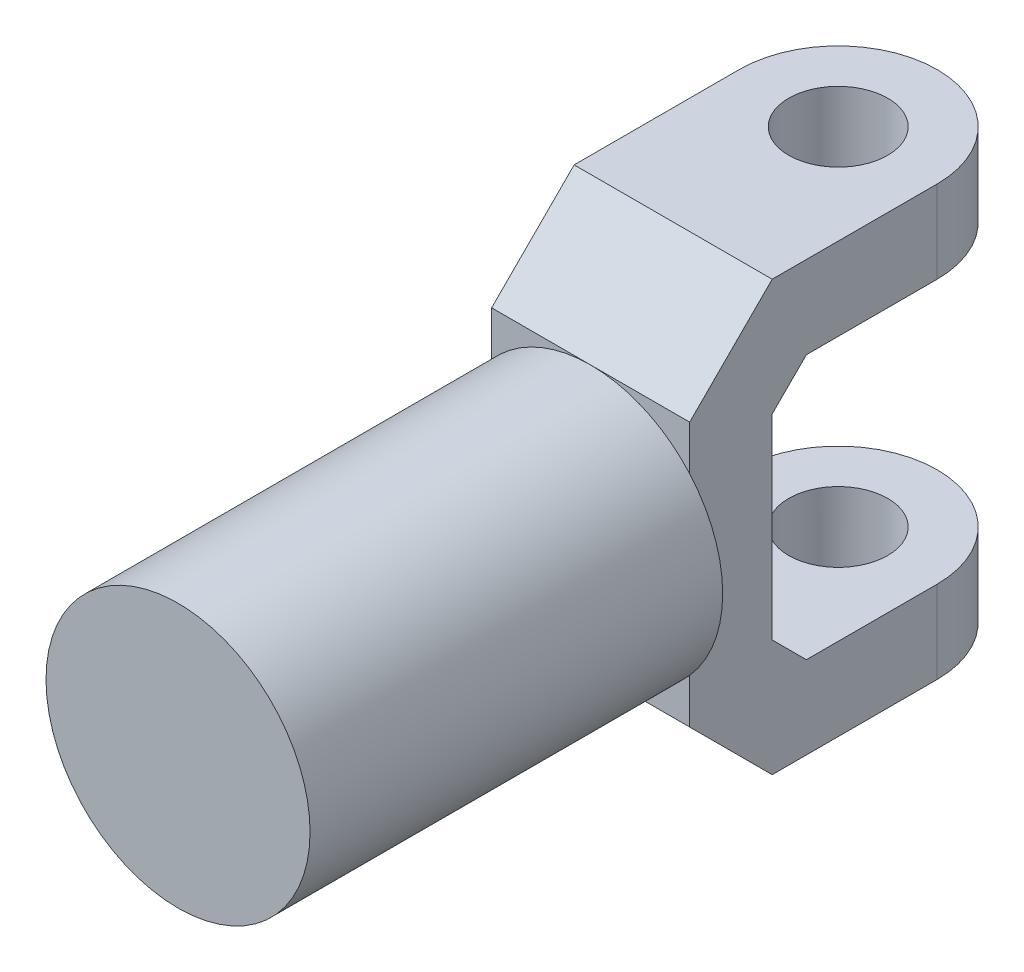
ISO-10303-21;
HEADER;
FILE_DESCRIPTION(('STEP AP214'),'2;1');
FILE_NAME('part.step','',(''),(''),'','','');
FILE_SCHEMA(('AUTOMOTIVE_DESIGN { 1 0 10303 214 1 1 1 1 }'));
ENDSEC;
DATA;
#1=APPLICATION_CONTEXT('core data for automotive mechanical design processes');
#2=APPLICATION_PROTOCOL_DEFINITION('international standard','automotive_design',2000,#1);
#3=PRODUCT_CONTEXT('',#1,'mechanical');
#4=PRODUCT('Part','Part','',(#3));
#5=PRODUCT_RELATED_PRODUCT_CATEGORY('part','',(#4));
#6=PRODUCT_DEFINITION_FORMATION('','',#4);
#7=PRODUCT_DEFINITION_CONTEXT('part definition',#1,'design');
#8=PRODUCT_DEFINITION('design','',#6,#7);
#9=PRODUCT_DEFINITION_SHAPE('','',#8);
#10=(LENGTH_UNIT() NAMED_UNIT(*) SI_UNIT(.MILLI.,.METRE.));
#11=(NAMED_UNIT(*) PLANE_ANGLE_UNIT() SI_UNIT($,.RADIAN.));
#12=(NAMED_UNIT(*) SI_UNIT($,.STERADIAN.) SOLID_ANGLE_UNIT());
#13=UNCERTAINTY_MEASURE_WITH_UNIT(LENGTH_MEASURE(1.E-05),#10,'distance_accuracy_value','');
#14=(GEOMETRIC_REPRESENTATION_CONTEXT(3) GLOBAL_UNCERTAINTY_ASSIGNED_CONTEXT((#13)) GLOBAL_UNIT_ASSIGNED_CONTEXT((#10,
#11,#12)) REPRESENTATION_CONTEXT('',''));
#15=CARTESIAN_POINT('',(0.,0.,0.));
#16=DIRECTION('',(0.,0.,1.));
#17=DIRECTION('',(1.,0.,0.));
#18=AXIS2_PLACEMENT_3D('',#15,#16,#17);
#19=CARTESIAN_POINT('',(0.,0.,0.));
#20=DIRECTION('',(0.,0.,1.));
#21=DIRECTION('',(1.,0.,0.));
#22=AXIS2_PLACEMENT_3D('',#19,#20,#21);
#23=PLANE('',#22);
#24=DIRECTION('',(0.,-1.,0.));
#25=VECTOR('',#24,1.);
#26=CARTESIAN_POINT('',(30.,-40.,0.));
#27=LINE('',#26,#25);
#28=CARTESIAN_POINT('',(30.,26.4575131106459,0.));
#29=VERTEX_POINT('',#28);
#30=CARTESIAN_POINT('',(30.,-26.4575131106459,0.));
#31=VERTEX_POINT('',#30);
#32=EDGE_CURVE('E168',#29,#31,#27,.T.);
#33=ORIENTED_EDGE('',*,*,#32,.F.);
#34=CARTESIAN_POINT('',(0.,0.,0.));
#35=DIRECTION('',(0.,0.,1.));
#36=DIRECTION('',(1.,0.,0.));
#37=AXIS2_PLACEMENT_3D('',#34,#35,#36);
#38=CIRCLE('',#37,40.);
#39=EDGE_CURVE('E183',#31,#29,#38,.T.);
#40=ORIENTED_EDGE('',*,*,#39,.F.);
#41=EDGE_LOOP('',(#33,#40));
#42=FACE_BOUND('',#41,.T.);
#43=ADVANCED_FACE('F36',(#42),#23,.F.);
#44=CARTESIAN_POINT('',(0.,0.,125.));
#45=DIRECTION('',(0.,0.,-1.));
#46=DIRECTION('',(-1.,0.,0.));
#47=AXIS2_PLACEMENT_3D('',#44,#45,#46);
#48=CYLINDRICAL_SURFACE('',#47,40.);
#49=CARTESIAN_POINT('',(0.,0.,125.));
#50=DIRECTION('',(0.,0.,1.));
#51=DIRECTION('',(1.,0.,0.));
#52=AXIS2_PLACEMENT_3D('',#49,#50,#51);
#53=CIRCLE('',#52,40.);
#54=CARTESIAN_POINT('',(40.,0.,125.));
#55=VERTEX_POINT('',#54);
#56=EDGE_CURVE('E192',#55,#55,#53,.T.);
#57=ORIENTED_EDGE('',*,*,#56,.F.);
#58=EDGE_LOOP('',(#57));
#59=FACE_BOUND('',#58,.T.);
#60=CARTESIAN_POINT('',(0.,40.,0.));
#61=VERTEX_POINT('',#60);
#62=EDGE_CURVE('E162',#29,#61,#38,.T.);
#63=ORIENTED_EDGE('',*,*,#62,.T.);
#64=CARTESIAN_POINT('',(-30.,26.4575131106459,0.));
#65=VERTEX_POINT('',#64);
#66=EDGE_CURVE('E195',#61,#65,#38,.T.);
#67=ORIENTED_EDGE('',*,*,#66,.T.);
#68=CARTESIAN_POINT('',(-30.,-26.4575131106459,0.));
#69=VERTEX_POINT('',#68);
#70=EDGE_CURVE('E372',#65,#69,#38,.T.);
#71=ORIENTED_EDGE('',*,*,#70,.T.);
#72=CARTESIAN_POINT('',(0.,-40.,0.));
#73=VERTEX_POINT('',#72);
#74=EDGE_CURVE('E303',#69,#73,#38,.T.);
#75=ORIENTED_EDGE('',*,*,#74,.T.);
#76=EDGE_CURVE('E186',#73,#31,#38,.T.);
#77=ORIENTED_EDGE('',*,*,#76,.T.);
#78=ORIENTED_EDGE('',*,*,#39,.T.);
#79=EDGE_LOOP('',(#63,#67,#71,#75,#77,#78));
#80=FACE_BOUND('',#79,.T.);
#81=ADVANCED_FACE('F351',(#59,#80),#48,.T.);
#82=CARTESIAN_POINT('',(0.,0.,125.));
#83=DIRECTION('',(0.,0.,1.));
#84=DIRECTION('',(1.,0.,0.));
#85=AXIS2_PLACEMENT_3D('',#82,#83,#84);
#86=PLANE('',#85);
#87=ORIENTED_EDGE('',*,*,#56,.T.);
#88=EDGE_LOOP('',(#87));
#89=FACE_BOUND('',#88,.T.);
#90=ADVANCED_FACE('F358',(#89),#86,.T.);
#91=ORIENTED_EDGE('',*,*,#70,.F.);
#92=DIRECTION('',(0.,-1.,0.));
#93=VECTOR('',#92,1.);
#94=CARTESIAN_POINT('',(-30.,-40.,0.));
#95=LINE('',#94,#93);
#96=EDGE_CURVE('E199',#65,#69,#95,.T.);
#97=ORIENTED_EDGE('',*,*,#96,.T.);
#98=EDGE_LOOP('',(#91,#97));
#99=FACE_BOUND('',#98,.T.);
#100=ADVANCED_FACE('F354',(#99),#23,.F.);
#101=CARTESIAN_POINT('',(30.,-40.,0.));
#102=DIRECTION('',(0.,0.,-1.));
#103=DIRECTION('',(-1.,0.,0.));
#104=AXIS2_PLACEMENT_3D('',#101,#102,#103);
#105=PLANE('',#104);
#106=ORIENTED_EDGE('',*,*,#62,.F.);
#107=CARTESIAN_POINT('',(30.,40.,0.));
#108=VERTEX_POINT('',#107);
#109=EDGE_CURVE('E157',#108,#29,#27,.T.);
#110=ORIENTED_EDGE('',*,*,#109,.F.);
#111=DIRECTION('',(-1.,0.,0.));
#112=VECTOR('',#111,1.);
#113=CARTESIAN_POINT('',(30.,40.,0.));
#114=LINE('',#113,#112);
#115=EDGE_CURVE('E161',#108,#61,#114,.T.);
#116=ORIENTED_EDGE('',*,*,#115,.T.);
#117=EDGE_LOOP('',(#106,#110,#116));
#118=FACE_BOUND('',#117,.T.);
#119=ADVANCED_FACE('F159',(#118),#105,.F.);
#120=ORIENTED_EDGE('',*,*,#66,.F.);
#121=CARTESIAN_POINT('',(-30.,40.,0.));
#122=VERTEX_POINT('',#121);
#123=EDGE_CURVE('E182',#61,#122,#114,.T.);
#124=ORIENTED_EDGE('',*,*,#123,.T.);
#125=EDGE_CURVE('E253',#122,#65,#95,.T.);
#126=ORIENTED_EDGE('',*,*,#125,.T.);
#127=EDGE_LOOP('',(#120,#124,#126));
#128=FACE_BOUND('',#127,.T.);
#129=ADVANCED_FACE('F368',(#128),#105,.F.);
#130=ORIENTED_EDGE('',*,*,#74,.F.);
#131=CARTESIAN_POINT('',(-30.,-40.,0.));
#132=VERTEX_POINT('',#131);
#133=EDGE_CURVE('E251',#69,#132,#95,.T.);
#134=ORIENTED_EDGE('',*,*,#133,.T.);
#135=DIRECTION('',(-1.,0.,0.));
#136=VECTOR('',#135,1.);
#137=CARTESIAN_POINT('',(30.,-40.,0.));
#138=LINE('',#137,#136);
#139=EDGE_CURVE('E285',#73,#132,#138,.T.);
#140=ORIENTED_EDGE('',*,*,#139,.F.);
#141=EDGE_LOOP('',(#130,#134,#140));
#142=FACE_BOUND('',#141,.T.);
#143=ADVANCED_FACE('F306',(#142),#105,.F.);
#144=CARTESIAN_POINT('',(30.,40.,0.));
#145=DIRECTION('',(0.,-0.707106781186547,-0.707106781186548));
#146=DIRECTION('',(0.,0.707106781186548,-0.707106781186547));
#147=AXIS2_PLACEMENT_3D('',#144,#145,#146);
#148=PLANE('',#147);
#149=DIRECTION('',(0.,-0.707106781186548,0.707106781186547));
#150=VECTOR('',#149,1.);
#151=CARTESIAN_POINT('',(-30.,40.,0.));
#152=LINE('',#151,#150);
#153=CARTESIAN_POINT('',(-30.,65.,-25.));
#154=VERTEX_POINT('',#153);
#155=EDGE_CURVE('E249',#154,#122,#152,.T.);
#156=ORIENTED_EDGE('',*,*,#155,.T.);
#157=ORIENTED_EDGE('',*,*,#123,.F.);
#158=ORIENTED_EDGE('',*,*,#115,.F.);
#159=DIRECTION('',(0.,-0.707106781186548,0.707106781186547));
#160=VECTOR('',#159,1.);
#161=CARTESIAN_POINT('',(30.,40.,0.));
#162=LINE('',#161,#160);
#163=CARTESIAN_POINT('',(30.,65.,-25.));
#164=VERTEX_POINT('',#163);
#165=EDGE_CURVE('E170',#164,#108,#162,.T.);
#166=ORIENTED_EDGE('',*,*,#165,.F.);
#167=DIRECTION('',(-1.,0.,0.));
#168=VECTOR('',#167,1.);
#169=CARTESIAN_POINT('',(30.,65.,-25.));
#170=LINE('',#169,#168);
#171=EDGE_CURVE('E243',#164,#154,#170,.T.);
#172=ORIENTED_EDGE('',*,*,#171,.T.);
#173=EDGE_LOOP('',(#156,#157,#158,#166,#172));
#174=FACE_BOUND('',#173,.T.);
#175=ADVANCED_FACE('F181',(#174),#148,.F.);
#176=ORIENTED_EDGE('',*,*,#76,.F.);
#177=CARTESIAN_POINT('',(30.,-40.,0.));
#178=VERTEX_POINT('',#177);
#179=EDGE_CURVE('E188',#178,#73,#138,.T.);
#180=ORIENTED_EDGE('',*,*,#179,.F.);
#181=EDGE_CURVE('E166',#31,#178,#27,.T.);
#182=ORIENTED_EDGE('',*,*,#181,.F.);
#183=EDGE_LOOP('',(#176,#180,#182));
#184=FACE_BOUND('',#183,.T.);
#185=ADVANCED_FACE('F300',(#184),#105,.F.);
#186=CARTESIAN_POINT('',(30.,-40.,0.));
#187=DIRECTION('',(0.,0.707106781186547,-0.707106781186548));
#188=DIRECTION('',(0.,0.707106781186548,0.707106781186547));
#189=AXIS2_PLACEMENT_3D('',#186,#187,#188);
#190=PLANE('',#189);
#191=DIRECTION('',(0.,-0.707106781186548,-0.707106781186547));
#192=VECTOR('',#191,1.);
#193=CARTESIAN_POINT('',(-30.,-40.,0.));
#194=LINE('',#193,#192);
#195=CARTESIAN_POINT('',(-30.,-65.,-25.));
#196=VERTEX_POINT('',#195);
#197=EDGE_CURVE('E256',#132,#196,#194,.T.);
#198=ORIENTED_EDGE('',*,*,#197,.T.);
#199=DIRECTION('',(-1.,0.,0.));
#200=VECTOR('',#199,1.);
#201=CARTESIAN_POINT('',(30.,-65.,-25.));
#202=LINE('',#201,#200);
#203=CARTESIAN_POINT('',(30.,-65.,-25.));
#204=VERTEX_POINT('',#203);
#205=EDGE_CURVE('E283',#204,#196,#202,.T.);
#206=ORIENTED_EDGE('',*,*,#205,.F.);
#207=DIRECTION('',(0.,-0.707106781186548,-0.707106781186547));
#208=VECTOR('',#207,1.);
#209=CARTESIAN_POINT('',(30.,-40.,0.));
#210=LINE('',#209,#208);
#211=EDGE_CURVE('E165',#178,#204,#210,.T.);
#212=ORIENTED_EDGE('',*,*,#211,.F.);
#213=ORIENTED_EDGE('',*,*,#179,.T.);
#214=ORIENTED_EDGE('',*,*,#139,.T.);
#215=EDGE_LOOP('',(#198,#206,#212,#213,#214));
#216=FACE_BOUND('',#215,.T.);
#217=ADVANCED_FACE('F296',(#216),#190,.F.);
#218=CARTESIAN_POINT('',(30.,-65.,-25.));
#219=DIRECTION('',(0.,1.,0.));
#220=DIRECTION('',(0.,0.,1.));
#221=AXIS2_PLACEMENT_3D('',#218,#219,#220);
#222=PLANE('',#221);
#223=CARTESIAN_POINT('',(0.,-65.,-75.));
#224=DIRECTION('',(0.,1.,0.));
#225=DIRECTION('',(0.,0.,1.));
#226=AXIS2_PLACEMENT_3D('',#223,#224,#225);
#227=CIRCLE('',#226,15.);
#228=CARTESIAN_POINT('',(0.,-65.,-60.));
#229=VERTEX_POINT('',#228);
#230=EDGE_CURVE('E225',#229,#229,#227,.T.);
#231=ORIENTED_EDGE('',*,*,#230,.T.);
#232=EDGE_LOOP('',(#231));
#233=FACE_BOUND('',#232,.T.);
#234=DIRECTION('',(0.,0.,-1.));
#235=VECTOR('',#234,1.);
#236=CARTESIAN_POINT('',(-30.,-65.,-25.));
#237=LINE('',#236,#235);
#238=CARTESIAN_POINT('',(-30.,-65.,-75.));
#239=VERTEX_POINT('',#238);
#240=EDGE_CURVE('E258',#196,#239,#237,.T.);
#241=ORIENTED_EDGE('',*,*,#240,.T.);
#242=CARTESIAN_POINT('',(0.,-65.,-75.));
#243=DIRECTION('',(0.,1.,0.));
#244=DIRECTION('',(0.,0.,1.));
#245=AXIS2_PLACEMENT_3D('',#242,#243,#244);
#246=CIRCLE('',#245,30.);
#247=CARTESIAN_POINT('',(0.,-65.,-105.));
#248=VERTEX_POINT('',#247);
#249=EDGE_CURVE('E209',#239,#248,#246,.F.);
#250=ORIENTED_EDGE('',*,*,#249,.T.);
#251=CARTESIAN_POINT('',(0.,-65.,-75.));
#252=DIRECTION('',(0.,1.,0.));
#253=DIRECTION('',(0.,0.,1.));
#254=AXIS2_PLACEMENT_3D('',#251,#252,#253);
#255=CIRCLE('',#254,30.);
#256=CARTESIAN_POINT('',(30.,-65.,-75.));
#257=VERTEX_POINT('',#256);
#258=EDGE_CURVE('E207',#248,#257,#255,.F.);
#259=ORIENTED_EDGE('',*,*,#258,.T.);
#260=DIRECTION('',(0.,0.,-1.));
#261=VECTOR('',#260,1.);
#262=CARTESIAN_POINT('',(30.,-65.,-25.));
#263=LINE('',#262,#261);
#264=EDGE_CURVE('E313',#204,#257,#263,.T.);
#265=ORIENTED_EDGE('',*,*,#264,.F.);
#266=ORIENTED_EDGE('',*,*,#205,.T.);
#267=EDGE_LOOP('',(#241,#250,#259,#265,#266));
#268=FACE_BOUND('',#267,.T.);
#269=ADVANCED_FACE('F314',(#233,#268),#222,.F.);
#270=CARTESIAN_POINT('',(30.,-40.,-105.));
#271=DIRECTION('',(0.,-1.,0.));
#272=DIRECTION('',(0.,0.,-1.));
#273=AXIS2_PLACEMENT_3D('',#270,#271,#272);
#274=PLANE('',#273);
#275=CARTESIAN_POINT('',(0.,-40.,-75.));
#276=DIRECTION('',(0.,-1.,0.));
#277=DIRECTION('',(0.,0.,-1.));
#278=AXIS2_PLACEMENT_3D('',#275,#276,#277);
#279=CIRCLE('',#278,15.);
#280=CARTESIAN_POINT('',(0.,-40.,-90.));
#281=VERTEX_POINT('',#280);
#282=EDGE_CURVE('E252',#281,#281,#279,.T.);
#283=ORIENTED_EDGE('',*,*,#282,.T.);
#284=EDGE_LOOP('',(#283));
#285=FACE_BOUND('',#284,.T.);
#286=CARTESIAN_POINT('',(0.,-40.,-75.));
#287=DIRECTION('',(0.,-1.,0.));
#288=DIRECTION('',(0.,0.,-1.));
#289=AXIS2_PLACEMENT_3D('',#286,#287,#288);
#290=CIRCLE('',#289,30.);
#291=CARTESIAN_POINT('',(30.,-40.,-75.));
#292=VERTEX_POINT('',#291);
#293=CARTESIAN_POINT('',(0.,-40.,-105.));
#294=VERTEX_POINT('',#293);
#295=EDGE_CURVE('E196',#292,#294,#290,.F.);
#296=ORIENTED_EDGE('',*,*,#295,.T.);
#297=CARTESIAN_POINT('',(0.,-40.,-75.));
#298=DIRECTION('',(0.,-1.,0.));
#299=DIRECTION('',(0.,0.,-1.));
#300=AXIS2_PLACEMENT_3D('',#297,#298,#299);
#301=CIRCLE('',#300,30.);
#302=CARTESIAN_POINT('',(-30.,-40.,-75.));
#303=VERTEX_POINT('',#302);
#304=EDGE_CURVE('E198',#294,#303,#301,.F.);
#305=ORIENTED_EDGE('',*,*,#304,.T.);
#306=DIRECTION('',(0.,0.,1.));
#307=VECTOR('',#306,1.);
#308=CARTESIAN_POINT('',(-30.,-40.,-105.));
#309=LINE('',#308,#307);
#310=CARTESIAN_POINT('',(-30.,-40.,-35.3553390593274));
#311=VERTEX_POINT('',#310);
#312=EDGE_CURVE('E261',#303,#311,#309,.T.);
#313=ORIENTED_EDGE('',*,*,#312,.T.);
#314=DIRECTION('',(-1.,0.,0.));
#315=VECTOR('',#314,1.);
#316=CARTESIAN_POINT('',(30.,-40.,-35.3553390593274));
#317=LINE('',#316,#315);
#318=CARTESIAN_POINT('',(30.,-40.,-35.3553390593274));
#319=VERTEX_POINT('',#318);
#320=EDGE_CURVE('E281',#319,#311,#317,.T.);
#321=ORIENTED_EDGE('',*,*,#320,.F.);
#322=DIRECTION('',(0.,0.,1.));
#323=VECTOR('',#322,1.);
#324=CARTESIAN_POINT('',(30.,-40.,-105.));
#325=LINE('',#324,#323);
#326=EDGE_CURVE('E317',#292,#319,#325,.T.);
#327=ORIENTED_EDGE('',*,*,#326,.F.);
#328=EDGE_LOOP('',(#296,#305,#313,#321,#327));
#329=FACE_BOUND('',#328,.T.);
#330=ADVANCED_FACE('F405',(#285,#329),#274,.F.);
#331=CARTESIAN_POINT('',(30.,-40.,-35.3553390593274));
#332=DIRECTION('',(0.,-0.707106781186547,0.707106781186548));
#333=DIRECTION('',(0.,-0.707106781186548,-0.707106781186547));
#334=AXIS2_PLACEMENT_3D('',#331,#332,#333);
#335=PLANE('',#334);
#336=DIRECTION('',(0.,0.707106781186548,0.707106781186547));
#337=VECTOR('',#336,1.);
#338=CARTESIAN_POINT('',(-30.,-40.,-35.3553390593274));
#339=LINE('',#338,#337);
#340=CARTESIAN_POINT('',(-30.,-29.6446609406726,-25.));
#341=VERTEX_POINT('',#340);
#342=EDGE_CURVE('E263',#311,#341,#339,.T.);
#343=ORIENTED_EDGE('',*,*,#342,.T.);
#344=DIRECTION('',(-1.,0.,0.));
#345=VECTOR('',#344,1.);
#346=CARTESIAN_POINT('',(30.,-29.6446609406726,-25.));
#347=LINE('',#346,#345);
#348=CARTESIAN_POINT('',(30.,-29.6446609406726,-25.));
#349=VERTEX_POINT('',#348);
#350=EDGE_CURVE('E278',#349,#341,#347,.T.);
#351=ORIENTED_EDGE('',*,*,#350,.F.);
#352=DIRECTION('',(0.,0.707106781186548,0.707106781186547));
#353=VECTOR('',#352,1.);
#354=CARTESIAN_POINT('',(30.,-40.,-35.3553390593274));
#355=LINE('',#354,#353);
#356=EDGE_CURVE('E319',#319,#349,#355,.T.);
#357=ORIENTED_EDGE('',*,*,#356,.F.);
#358=ORIENTED_EDGE('',*,*,#320,.T.);
#359=EDGE_LOOP('',(#343,#351,#357,#358));
#360=FACE_BOUND('',#359,.T.);
#361=ADVANCED_FACE('F413',(#360),#335,.F.);
#362=CARTESIAN_POINT('',(30.,29.6446609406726,-25.));
#363=DIRECTION('',(0.,0.,1.));
#364=DIRECTION('',(1.,0.,0.));
#365=AXIS2_PLACEMENT_3D('',#362,#363,#364);
#366=PLANE('',#365);
#367=DIRECTION('',(0.,1.,0.));
#368=VECTOR('',#367,1.);
#369=CARTESIAN_POINT('',(-30.,29.6446609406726,-25.));
#370=LINE('',#369,#368);
#371=CARTESIAN_POINT('',(-30.,29.6446609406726,-25.));
#372=VERTEX_POINT('',#371);
#373=EDGE_CURVE('E265',#341,#372,#370,.T.);
#374=ORIENTED_EDGE('',*,*,#373,.T.);
#375=DIRECTION('',(-1.,0.,0.));
#376=VECTOR('',#375,1.);
#377=CARTESIAN_POINT('',(30.,29.6446609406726,-25.));
#378=LINE('',#377,#376);
#379=CARTESIAN_POINT('',(30.,29.6446609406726,-25.));
#380=VERTEX_POINT('',#379);
#381=EDGE_CURVE('E275',#380,#372,#378,.T.);
#382=ORIENTED_EDGE('',*,*,#381,.F.);
#383=DIRECTION('',(0.,1.,0.));
#384=VECTOR('',#383,1.);
#385=CARTESIAN_POINT('',(30.,29.6446609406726,-25.));
#386=LINE('',#385,#384);
#387=EDGE_CURVE('E245',#349,#380,#386,.T.);
#388=ORIENTED_EDGE('',*,*,#387,.F.);
#389=ORIENTED_EDGE('',*,*,#350,.T.);
#390=EDGE_LOOP('',(#374,#382,#388,#389));
#391=FACE_BOUND('',#390,.T.);
#392=ADVANCED_FACE('F328',(#391),#366,.F.);
#393=CARTESIAN_POINT('',(30.,40.,-35.3553390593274));
#394=DIRECTION('',(0.,0.707106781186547,0.707106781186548));
#395=DIRECTION('',(0.,-0.707106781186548,0.707106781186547));
#396=AXIS2_PLACEMENT_3D('',#393,#394,#395);
#397=PLANE('',#396);
#398=DIRECTION('',(0.,0.707106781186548,-0.707106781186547));
#399=VECTOR('',#398,1.);
#400=CARTESIAN_POINT('',(-30.,40.,-35.3553390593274));
#401=LINE('',#400,#399);
#402=CARTESIAN_POINT('',(-30.,40.,-35.3553390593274));
#403=VERTEX_POINT('',#402);
#404=EDGE_CURVE('E267',#372,#403,#401,.T.);
#405=ORIENTED_EDGE('',*,*,#404,.T.);
#406=DIRECTION('',(-1.,0.,0.));
#407=VECTOR('',#406,1.);
#408=CARTESIAN_POINT('',(30.,40.,-35.3553390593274));
#409=LINE('',#408,#407);
#410=CARTESIAN_POINT('',(30.,40.,-35.3553390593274));
#411=VERTEX_POINT('',#410);
#412=EDGE_CURVE('E273',#411,#403,#409,.T.);
#413=ORIENTED_EDGE('',*,*,#412,.F.);
#414=DIRECTION('',(0.,0.707106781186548,-0.707106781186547));
#415=VECTOR('',#414,1.);
#416=CARTESIAN_POINT('',(30.,40.,-35.3553390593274));
#417=LINE('',#416,#415);
#418=EDGE_CURVE('E240',#380,#411,#417,.T.);
#419=ORIENTED_EDGE('',*,*,#418,.F.);
#420=ORIENTED_EDGE('',*,*,#381,.T.);
#421=EDGE_LOOP('',(#405,#413,#419,#420));
#422=FACE_BOUND('',#421,.T.);
#423=ADVANCED_FACE('F332',(#422),#397,.F.);
#424=CARTESIAN_POINT('',(30.,40.,-105.));
#425=DIRECTION('',(0.,1.,0.));
#426=DIRECTION('',(0.,0.,1.));
#427=AXIS2_PLACEMENT_3D('',#424,#425,#426);
#428=PLANE('',#427);
#429=CARTESIAN_POINT('',(0.,40.,-75.));
#430=DIRECTION('',(0.,1.,0.));
#431=DIRECTION('',(0.,0.,1.));
#432=AXIS2_PLACEMENT_3D('',#429,#430,#431);
#433=CIRCLE('',#432,15.);
#434=CARTESIAN_POINT('',(0.,40.,-60.));
#435=VERTEX_POINT('',#434);
#436=EDGE_CURVE('E612',#435,#435,#433,.T.);
#437=ORIENTED_EDGE('',*,*,#436,.T.);
#438=EDGE_LOOP('',(#437));
#439=FACE_BOUND('',#438,.T.);
#440=DIRECTION('',(0.,0.,-1.));
#441=VECTOR('',#440,1.);
#442=CARTESIAN_POINT('',(-30.,40.,-105.));
#443=LINE('',#442,#441);
#444=CARTESIAN_POINT('',(-30.,40.,-75.));
#445=VERTEX_POINT('',#444);
#446=EDGE_CURVE('E269',#403,#445,#443,.T.);
#447=ORIENTED_EDGE('',*,*,#446,.T.);
#448=CARTESIAN_POINT('',(0.,40.,-75.));
#449=DIRECTION('',(0.,1.,0.));
#450=DIRECTION('',(0.,0.,1.));
#451=AXIS2_PLACEMENT_3D('',#448,#449,#450);
#452=CIRCLE('',#451,30.);
#453=CARTESIAN_POINT('',(0.,40.,-105.));
#454=VERTEX_POINT('',#453);
#455=EDGE_CURVE('E11',#445,#454,#452,.F.);
#456=ORIENTED_EDGE('',*,*,#455,.T.);
#457=CARTESIAN_POINT('',(0.,40.,-75.));
#458=DIRECTION('',(0.,1.,0.));
#459=DIRECTION('',(0.,0.,1.));
#460=AXIS2_PLACEMENT_3D('',#457,#458,#459);
#461=CIRCLE('',#460,30.);
#462=CARTESIAN_POINT('',(30.,40.,-75.));
#463=VERTEX_POINT('',#462);
#464=EDGE_CURVE('E45',#454,#463,#461,.F.);
#465=ORIENTED_EDGE('',*,*,#464,.T.);
#466=DIRECTION('',(0.,0.,-1.));
#467=VECTOR('',#466,1.);
#468=CARTESIAN_POINT('',(30.,40.,-105.));
#469=LINE('',#468,#467);
#470=EDGE_CURVE('E238',#411,#463,#469,.T.);
#471=ORIENTED_EDGE('',*,*,#470,.F.);
#472=ORIENTED_EDGE('',*,*,#412,.T.);
#473=EDGE_LOOP('',(#447,#456,#465,#471,#472));
#474=FACE_BOUND('',#473,.T.);
#475=ADVANCED_FACE('F236',(#439,#474),#428,.F.);
#476=CARTESIAN_POINT('',(30.,65.,-25.));
#477=DIRECTION('',(0.,-1.,0.));
#478=DIRECTION('',(0.,0.,-1.));
#479=AXIS2_PLACEMENT_3D('',#476,#477,#478);
#480=PLANE('',#479);
#481=CARTESIAN_POINT('',(0.,65.,-75.));
#482=DIRECTION('',(0.,1.,0.));
#483=DIRECTION('',(0.,0.,1.));
#484=AXIS2_PLACEMENT_3D('',#481,#482,#483);
#485=CIRCLE('',#484,15.);
#486=CARTESIAN_POINT('',(0.,65.,-60.));
#487=VERTEX_POINT('',#486);
#488=EDGE_CURVE('E220',#487,#487,#485,.T.);
#489=ORIENTED_EDGE('',*,*,#488,.F.);
#490=EDGE_LOOP('',(#489));
#491=FACE_BOUND('',#490,.T.);
#492=CARTESIAN_POINT('',(0.,65.,-75.));
#493=DIRECTION('',(0.,-1.,0.));
#494=DIRECTION('',(0.,0.,-1.));
#495=AXIS2_PLACEMENT_3D('',#492,#493,#494);
#496=CIRCLE('',#495,30.);
#497=CARTESIAN_POINT('',(30.,65.,-75.));
#498=VERTEX_POINT('',#497);
#499=CARTESIAN_POINT('',(0.,65.,-105.));
#500=VERTEX_POINT('',#499);
#501=EDGE_CURVE('E59',#498,#500,#496,.F.);
#502=ORIENTED_EDGE('',*,*,#501,.T.);
#503=CARTESIAN_POINT('',(0.,65.,-75.));
#504=DIRECTION('',(0.,-1.,0.));
#505=DIRECTION('',(0.,0.,-1.));
#506=AXIS2_PLACEMENT_3D('',#503,#504,#505);
#507=CIRCLE('',#506,30.);
#508=CARTESIAN_POINT('',(-30.,65.,-75.));
#509=VERTEX_POINT('',#508);
#510=EDGE_CURVE('E216',#500,#509,#507,.F.);
#511=ORIENTED_EDGE('',*,*,#510,.T.);
#512=DIRECTION('',(0.,0.,1.));
#513=VECTOR('',#512,1.);
#514=CARTESIAN_POINT('',(-30.,65.,-25.));
#515=LINE('',#514,#513);
#516=EDGE_CURVE('E177',#509,#154,#515,.T.);
#517=ORIENTED_EDGE('',*,*,#516,.T.);
#518=ORIENTED_EDGE('',*,*,#171,.F.);
#519=DIRECTION('',(0.,0.,1.));
#520=VECTOR('',#519,1.);
#521=CARTESIAN_POINT('',(30.,65.,-25.));
#522=LINE('',#521,#520);
#523=EDGE_CURVE('E173',#498,#164,#522,.T.);
#524=ORIENTED_EDGE('',*,*,#523,.F.);
#525=EDGE_LOOP('',(#502,#511,#517,#518,#524));
#526=FACE_BOUND('',#525,.T.);
#527=ADVANCED_FACE('F337',(#491,#526),#480,.F.);
#528=CARTESIAN_POINT('',(30.,0.,0.));
#529=DIRECTION('',(1.,0.,0.));
#530=DIRECTION('',(0.,0.,-1.));
#531=AXIS2_PLACEMENT_3D('',#528,#529,#530);
#532=PLANE('',#531);
#533=ORIENTED_EDGE('',*,*,#264,.T.);
#534=DIRECTION('',(0.,1.,0.));
#535=VECTOR('',#534,1.);
#536=CARTESIAN_POINT('',(30.,-40.,-75.));
#537=LINE('',#536,#535);
#538=EDGE_CURVE('E213',#257,#292,#537,.T.);
#539=ORIENTED_EDGE('',*,*,#538,.T.);
#540=ORIENTED_EDGE('',*,*,#326,.T.);
#541=ORIENTED_EDGE('',*,*,#356,.T.);
#542=ORIENTED_EDGE('',*,*,#387,.T.);
#543=ORIENTED_EDGE('',*,*,#418,.T.);
#544=ORIENTED_EDGE('',*,*,#470,.T.);
#545=DIRECTION('',(0.,1.,0.));
#546=VECTOR('',#545,1.);
#547=CARTESIAN_POINT('',(30.,65.,-75.));
#548=LINE('',#547,#546);
#549=EDGE_CURVE('E211',#463,#498,#548,.T.);
#550=ORIENTED_EDGE('',*,*,#549,.T.);
#551=ORIENTED_EDGE('',*,*,#523,.T.);
#552=ORIENTED_EDGE('',*,*,#165,.T.);
#553=ORIENTED_EDGE('',*,*,#109,.T.);
#554=ORIENTED_EDGE('',*,*,#32,.T.);
#555=ORIENTED_EDGE('',*,*,#181,.T.);
#556=ORIENTED_EDGE('',*,*,#211,.T.);
#557=EDGE_LOOP('',(#533,#539,#540,#541,#542,#543,#544,#550,#551,#552,#553,#554,#555,#556));
#558=FACE_BOUND('',#557,.T.);
#559=ADVANCED_FACE('F172',(#558),#532,.T.);
#560=CARTESIAN_POINT('',(-30.,0.,0.));
#561=DIRECTION('',(1.,0.,0.));
#562=DIRECTION('',(0.,0.,-1.));
#563=AXIS2_PLACEMENT_3D('',#560,#561,#562);
#564=PLANE('',#563);
#565=ORIENTED_EDGE('',*,*,#312,.F.);
#566=DIRECTION('',(0.,1.,0.));
#567=VECTOR('',#566,1.);
#568=CARTESIAN_POINT('',(-30.,0.,-75.));
#569=LINE('',#568,#567);
#570=EDGE_CURVE('E204',#303,#239,#569,.F.);
#571=ORIENTED_EDGE('',*,*,#570,.T.);
#572=ORIENTED_EDGE('',*,*,#240,.F.);
#573=ORIENTED_EDGE('',*,*,#197,.F.);
#574=ORIENTED_EDGE('',*,*,#133,.F.);
#575=ORIENTED_EDGE('',*,*,#96,.F.);
#576=ORIENTED_EDGE('',*,*,#125,.F.);
#577=ORIENTED_EDGE('',*,*,#155,.F.);
#578=ORIENTED_EDGE('',*,*,#516,.F.);
#579=DIRECTION('',(0.,1.,0.));
#580=VECTOR('',#579,1.);
#581=CARTESIAN_POINT('',(-30.,0.,-75.));
#582=LINE('',#581,#580);
#583=EDGE_CURVE('E201',#509,#445,#582,.F.);
#584=ORIENTED_EDGE('',*,*,#583,.T.);
#585=ORIENTED_EDGE('',*,*,#446,.F.);
#586=ORIENTED_EDGE('',*,*,#404,.F.);
#587=ORIENTED_EDGE('',*,*,#373,.F.);
#588=ORIENTED_EDGE('',*,*,#342,.F.);
#589=EDGE_LOOP('',(#565,#571,#572,#573,#574,#575,#576,#577,#578,#584,#585,#586,#587,#588));
#590=FACE_BOUND('',#589,.T.);
#591=ADVANCED_FACE('F312',(#590),#564,.F.);
#592=CARTESIAN_POINT('',(0.,-65.,-75.));
#593=DIRECTION('',(0.,1.,0.));
#594=DIRECTION('',(0.,0.,1.));
#595=AXIS2_PLACEMENT_3D('',#592,#593,#594);
#596=CYLINDRICAL_SURFACE('',#595,15.);
#597=ORIENTED_EDGE('',*,*,#488,.T.);
#598=EDGE_LOOP('',(#597));
#599=FACE_BOUND('',#598,.T.);
#600=ORIENTED_EDGE('',*,*,#436,.F.);
#601=EDGE_LOOP('',(#600));
#602=FACE_BOUND('',#601,.T.);
#603=ADVANCED_FACE('F460',(#599,#602),#596,.F.);
#604=ORIENTED_EDGE('',*,*,#230,.F.);
#605=EDGE_LOOP('',(#604));
#606=FACE_BOUND('',#605,.T.);
#607=ORIENTED_EDGE('',*,*,#282,.F.);
#608=EDGE_LOOP('',(#607));
#609=FACE_BOUND('',#608,.T.);
#610=ADVANCED_FACE('F473',(#606,#609),#596,.F.);
#611=CARTESIAN_POINT('',(0.,0.,-75.));
#612=DIRECTION('',(0.,-1.,0.));
#613=DIRECTION('',(0.,0.,-1.));
#614=AXIS2_PLACEMENT_3D('',#611,#612,#613);
#615=CYLINDRICAL_SURFACE('',#614,30.);
#616=ORIENTED_EDGE('',*,*,#538,.F.);
#617=ORIENTED_EDGE('',*,*,#258,.F.);
#618=DIRECTION('',(0.,1.,0.));
#619=VECTOR('',#618,1.);
#620=CARTESIAN_POINT('',(0.,-65.,-105.));
#621=LINE('',#620,#619);
#622=EDGE_CURVE('E218',#294,#248,#621,.F.);
#623=ORIENTED_EDGE('',*,*,#622,.F.);
#624=ORIENTED_EDGE('',*,*,#295,.F.);
#625=EDGE_LOOP('',(#616,#617,#623,#624));
#626=FACE_BOUND('',#625,.T.);
#627=ADVANCED_FACE('F467',(#626),#615,.T.);
#628=CARTESIAN_POINT('',(0.,-65.,-75.));
#629=DIRECTION('',(0.,1.,0.));
#630=DIRECTION('',(0.,0.,1.));
#631=AXIS2_PLACEMENT_3D('',#628,#629,#630);
#632=CYLINDRICAL_SURFACE('',#631,30.);
#633=ORIENTED_EDGE('',*,*,#249,.F.);
#634=ORIENTED_EDGE('',*,*,#570,.F.);
#635=ORIENTED_EDGE('',*,*,#304,.F.);
#636=ORIENTED_EDGE('',*,*,#622,.T.);
#637=EDGE_LOOP('',(#633,#634,#635,#636));
#638=FACE_BOUND('',#637,.T.);
#639=ADVANCED_FACE('F472',(#638),#632,.T.);
#640=CARTESIAN_POINT('',(0.,0.,-75.));
#641=DIRECTION('',(0.,-1.,0.));
#642=DIRECTION('',(0.,0.,-1.));
#643=AXIS2_PLACEMENT_3D('',#640,#641,#642);
#644=CYLINDRICAL_SURFACE('',#643,30.);
#645=ORIENTED_EDGE('',*,*,#549,.F.);
#646=ORIENTED_EDGE('',*,*,#464,.F.);
#647=DIRECTION('',(0.,1.,0.));
#648=VECTOR('',#647,1.);
#649=CARTESIAN_POINT('',(0.,40.,-105.));
#650=LINE('',#649,#648);
#651=EDGE_CURVE('E40',#500,#454,#650,.F.);
#652=ORIENTED_EDGE('',*,*,#651,.F.);
#653=ORIENTED_EDGE('',*,*,#501,.F.);
#654=EDGE_LOOP('',(#645,#646,#652,#653));
#655=FACE_BOUND('',#654,.T.);
#656=ADVANCED_FACE('F38',(#655),#644,.T.);
#657=CARTESIAN_POINT('',(0.,65.,-75.));
#658=DIRECTION('',(0.,1.,0.));
#659=DIRECTION('',(0.,0.,1.));
#660=AXIS2_PLACEMENT_3D('',#657,#658,#659);
#661=CYLINDRICAL_SURFACE('',#660,30.);
#662=ORIENTED_EDGE('',*,*,#455,.F.);
#663=ORIENTED_EDGE('',*,*,#583,.F.);
#664=ORIENTED_EDGE('',*,*,#510,.F.);
#665=ORIENTED_EDGE('',*,*,#651,.T.);
#666=EDGE_LOOP('',(#662,#663,#664,#665));
#667=FACE_BOUND('',#666,.T.);
#668=ADVANCED_FACE('F230',(#667),#661,.T.);
#669=CLOSED_SHELL('',(#43,#81,#90,#100,#119,#129,#143,#175,#185,#217,#269,#330,#361,#392,#423,
#475,#527,#559,#591,#603,#610,#627,#639,#656,#668));
#670=MANIFOLD_SOLID_BREP('B2',#669);
#671=ADVANCED_BREP_SHAPE_REPRESENTATION('',(#18,#670),#14);
#672=SHAPE_DEFINITION_REPRESENTATION(#9,#671);
ENDSEC;
END-ISO-10303-21;
